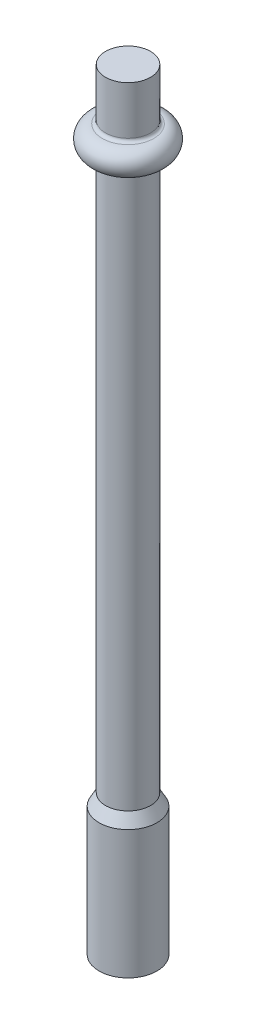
ISO-10303-21;
HEADER;
FILE_DESCRIPTION(('STEP AP214'),'2;1');
FILE_NAME('part.step','',(''),(''),'','','');
FILE_SCHEMA(('AUTOMOTIVE_DESIGN { 1 0 10303 214 1 1 1 1 }'));
ENDSEC;
DATA;
#1=APPLICATION_CONTEXT('core data for automotive mechanical design processes');
#2=APPLICATION_PROTOCOL_DEFINITION('international standard','automotive_design',2000,#1);
#3=PRODUCT_CONTEXT('',#1,'mechanical');
#4=PRODUCT('Part','Part','',(#3));
#5=PRODUCT_RELATED_PRODUCT_CATEGORY('part','',(#4));
#6=PRODUCT_DEFINITION_FORMATION('','',#4);
#7=PRODUCT_DEFINITION_CONTEXT('part definition',#1,'design');
#8=PRODUCT_DEFINITION('design','',#6,#7);
#9=PRODUCT_DEFINITION_SHAPE('','',#8);
#10=(LENGTH_UNIT() NAMED_UNIT(*) SI_UNIT(.MILLI.,.METRE.));
#11=(NAMED_UNIT(*) PLANE_ANGLE_UNIT() SI_UNIT($,.RADIAN.));
#12=(NAMED_UNIT(*) SI_UNIT($,.STERADIAN.) SOLID_ANGLE_UNIT());
#13=UNCERTAINTY_MEASURE_WITH_UNIT(LENGTH_MEASURE(1.E-05),#10,'distance_accuracy_value','');
#14=(GEOMETRIC_REPRESENTATION_CONTEXT(3) GLOBAL_UNCERTAINTY_ASSIGNED_CONTEXT((#13)) GLOBAL_UNIT_ASSIGNED_CONTEXT((#10,
#11,#12)) REPRESENTATION_CONTEXT('',''));
#15=CARTESIAN_POINT('',(0.,0.,0.));
#16=DIRECTION('',(0.,0.,1.));
#17=DIRECTION('',(1.,0.,0.));
#18=AXIS2_PLACEMENT_3D('',#15,#16,#17);
#19=CARTESIAN_POINT('',(0.,0.,0.));
#20=DIRECTION('',(0.,-1.,0.));
#21=DIRECTION('',(0.,0.,-1.));
#22=AXIS2_PLACEMENT_3D('',#19,#20,#21);
#23=PLANE('',#22);
#24=CARTESIAN_POINT('',(0.,0.,0.));
#25=DIRECTION('',(0.,-1.,0.));
#26=DIRECTION('',(0.,0.,-1.));
#27=AXIS2_PLACEMENT_3D('',#24,#25,#26);
#28=CIRCLE('',#27,4.5);
#29=CARTESIAN_POINT('',(0.,0.,-4.5));
#30=VERTEX_POINT('',#29);
#31=EDGE_CURVE('E10',#30,#30,#28,.T.);
#32=ORIENTED_EDGE('',*,*,#31,.T.);
#33=EDGE_LOOP('',(#32));
#34=FACE_BOUND('',#33,.T.);
#35=ADVANCED_FACE('F29',(#34),#23,.T.);
#36=CARTESIAN_POINT('',(0.,0.,0.));
#37=DIRECTION('',(0.,-1.,0.));
#38=DIRECTION('',(0.,0.,-1.));
#39=AXIS2_PLACEMENT_3D('',#36,#37,#38);
#40=CYLINDRICAL_SURFACE('',#39,4.5);
#41=CARTESIAN_POINT('',(0.,20.,0.));
#42=DIRECTION('',(0.,-1.,0.));
#43=DIRECTION('',(0.,0.,-1.));
#44=AXIS2_PLACEMENT_3D('',#41,#42,#43);
#45=CIRCLE('',#44,4.5);
#46=CARTESIAN_POINT('',(0.,20.,-4.5));
#47=VERTEX_POINT('',#46);
#48=EDGE_CURVE('E35',#47,#47,#45,.T.);
#49=ORIENTED_EDGE('',*,*,#48,.T.);
#50=EDGE_LOOP('',(#49));
#51=FACE_BOUND('',#50,.T.);
#52=ORIENTED_EDGE('',*,*,#31,.F.);
#53=EDGE_LOOP('',(#52));
#54=FACE_BOUND('',#53,.T.);
#55=ADVANCED_FACE('F73',(#51,#54),#40,.T.);
#56=CARTESIAN_POINT('',(0.,20.,0.));
#57=DIRECTION('',(0.,-1.,0.));
#58=DIRECTION('',(0.,0.,-1.));
#59=AXIS2_PLACEMENT_3D('',#56,#57,#58);
#60=CONICAL_SURFACE('',#59,4.5,0.504691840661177);
#61=CARTESIAN_POINT('',(0.,21.8102486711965,0.));
#62=DIRECTION('',(0.,-1.,0.));
#63=DIRECTION('',(0.,0.,-1.));
#64=AXIS2_PLACEMENT_3D('',#61,#62,#63);
#65=CIRCLE('',#64,3.5);
#66=CARTESIAN_POINT('',(0.,21.8102486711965,-3.5));
#67=VERTEX_POINT('',#66);
#68=EDGE_CURVE('E39',#67,#67,#65,.T.);
#69=ORIENTED_EDGE('',*,*,#68,.T.);
#70=EDGE_LOOP('',(#69));
#71=FACE_BOUND('',#70,.T.);
#72=ORIENTED_EDGE('',*,*,#48,.F.);
#73=EDGE_LOOP('',(#72));
#74=FACE_BOUND('',#73,.T.);
#75=ADVANCED_FACE('F77',(#71,#74),#60,.T.);
#76=CARTESIAN_POINT('',(0.,0.,0.));
#77=DIRECTION('',(0.,-1.,0.));
#78=DIRECTION('',(0.,0.,-1.));
#79=AXIS2_PLACEMENT_3D('',#76,#77,#78);
#80=CYLINDRICAL_SURFACE('',#79,3.5);
#81=CARTESIAN_POINT('',(0.,107.5,0.));
#82=DIRECTION('',(0.,-1.,0.));
#83=DIRECTION('',(0.,0.,-1.));
#84=AXIS2_PLACEMENT_3D('',#81,#82,#83);
#85=CIRCLE('',#84,3.5);
#86=CARTESIAN_POINT('',(0.,107.5,-3.5));
#87=VERTEX_POINT('',#86);
#88=EDGE_CURVE('E43',#87,#87,#85,.T.);
#89=ORIENTED_EDGE('',*,*,#88,.T.);
#90=EDGE_LOOP('',(#89));
#91=FACE_BOUND('',#90,.T.);
#92=ORIENTED_EDGE('',*,*,#68,.F.);
#93=EDGE_LOOP('',(#92));
#94=FACE_BOUND('',#93,.T.);
#95=ADVANCED_FACE('F81',(#91,#94),#80,.T.);
#96=CARTESIAN_POINT('',(0.,107.5,0.));
#97=DIRECTION('',(0.,-1.,0.));
#98=DIRECTION('',(0.,0.,-1.));
#99=AXIS2_PLACEMENT_3D('',#96,#97,#98);
#100=TOROIDAL_SURFACE('',#99,4.,0.5);
#101=CARTESIAN_POINT('',(0.,108.,0.));
#102=DIRECTION('',(0.,-1.,0.));
#103=DIRECTION('',(0.,0.,-1.));
#104=AXIS2_PLACEMENT_3D('',#101,#102,#103);
#105=CIRCLE('',#104,4.);
#106=CARTESIAN_POINT('',(0.,108.,-4.));
#107=VERTEX_POINT('',#106);
#108=EDGE_CURVE('E48',#107,#107,#105,.T.);
#109=ORIENTED_EDGE('',*,*,#108,.T.);
#110=EDGE_LOOP('',(#109));
#111=FACE_BOUND('',#110,.T.);
#112=ORIENTED_EDGE('',*,*,#88,.F.);
#113=EDGE_LOOP('',(#112));
#114=FACE_BOUND('',#113,.T.);
#115=ADVANCED_FACE('F88',(#111,#114),#100,.F.);
#116=CARTESIAN_POINT('',(0.,110.,0.));
#117=DIRECTION('',(0.,-1.,0.));
#118=DIRECTION('',(0.,0.,-1.));
#119=AXIS2_PLACEMENT_3D('',#116,#117,#118);
#120=TOROIDAL_SURFACE('',#119,4.,1.99999999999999);
#121=CARTESIAN_POINT('',(0.,112.,0.));
#122=DIRECTION('',(0.,-1.,0.));
#123=DIRECTION('',(0.,0.,-1.));
#124=AXIS2_PLACEMENT_3D('',#121,#122,#123);
#125=CIRCLE('',#124,4.);
#126=CARTESIAN_POINT('',(0.,112.,-4.));
#127=VERTEX_POINT('',#126);
#128=EDGE_CURVE('E51',#127,#127,#125,.T.);
#129=ORIENTED_EDGE('',*,*,#128,.T.);
#130=EDGE_LOOP('',(#129));
#131=FACE_BOUND('',#130,.T.);
#132=ORIENTED_EDGE('',*,*,#108,.F.);
#133=EDGE_LOOP('',(#132));
#134=FACE_BOUND('',#133,.T.);
#135=ADVANCED_FACE('F92',(#131,#134),#120,.T.);
#136=CARTESIAN_POINT('',(0.,112.5,0.));
#137=DIRECTION('',(0.,-1.,0.));
#138=DIRECTION('',(0.,0.,-1.));
#139=AXIS2_PLACEMENT_3D('',#136,#137,#138);
#140=TOROIDAL_SURFACE('',#139,4.,0.500000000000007);
#141=CARTESIAN_POINT('',(0.,112.5,0.));
#142=DIRECTION('',(0.,-1.,0.));
#143=DIRECTION('',(0.,0.,-1.));
#144=AXIS2_PLACEMENT_3D('',#141,#142,#143);
#145=CIRCLE('',#144,3.5);
#146=CARTESIAN_POINT('',(0.,112.5,-3.5));
#147=VERTEX_POINT('',#146);
#148=EDGE_CURVE('E54',#147,#147,#145,.T.);
#149=ORIENTED_EDGE('',*,*,#148,.T.);
#150=EDGE_LOOP('',(#149));
#151=FACE_BOUND('',#150,.T.);
#152=ORIENTED_EDGE('',*,*,#128,.F.);
#153=EDGE_LOOP('',(#152));
#154=FACE_BOUND('',#153,.T.);
#155=ADVANCED_FACE('F70',(#151,#154),#140,.F.);
#156=CARTESIAN_POINT('',(0.,0.,0.));
#157=DIRECTION('',(0.,-1.,0.));
#158=DIRECTION('',(0.,0.,-1.));
#159=AXIS2_PLACEMENT_3D('',#156,#157,#158);
#160=CYLINDRICAL_SURFACE('',#159,3.5);
#161=CARTESIAN_POINT('',(0.,120.,0.));
#162=DIRECTION('',(0.,-1.,0.));
#163=DIRECTION('',(0.,0.,-1.));
#164=AXIS2_PLACEMENT_3D('',#161,#162,#163);
#165=CIRCLE('',#164,3.5);
#166=CARTESIAN_POINT('',(0.,120.,-3.5));
#167=VERTEX_POINT('',#166);
#168=EDGE_CURVE('E57',#167,#167,#165,.T.);
#169=ORIENTED_EDGE('',*,*,#168,.T.);
#170=EDGE_LOOP('',(#169));
#171=FACE_BOUND('',#170,.T.);
#172=ORIENTED_EDGE('',*,*,#148,.F.);
#173=EDGE_LOOP('',(#172));
#174=FACE_BOUND('',#173,.T.);
#175=ADVANCED_FACE('F61',(#171,#174),#160,.T.);
#176=CARTESIAN_POINT('',(0.,120.,0.));
#177=DIRECTION('',(0.,1.,0.));
#178=DIRECTION('',(0.,0.,1.));
#179=AXIS2_PLACEMENT_3D('',#176,#177,#178);
#180=PLANE('',#179);
#181=ORIENTED_EDGE('',*,*,#168,.F.);
#182=EDGE_LOOP('',(#181));
#183=FACE_BOUND('',#182,.T.);
#184=ADVANCED_FACE('F64',(#183),#180,.T.);
#185=CLOSED_SHELL('',(#35,#55,#75,#95,#115,#135,#155,#175,#184));
#186=MANIFOLD_SOLID_BREP('B2',#185);
#187=ADVANCED_BREP_SHAPE_REPRESENTATION('',(#18,#186),#14);
#188=SHAPE_DEFINITION_REPRESENTATION(#9,#187);
ENDSEC;
END-ISO-10303-21;
